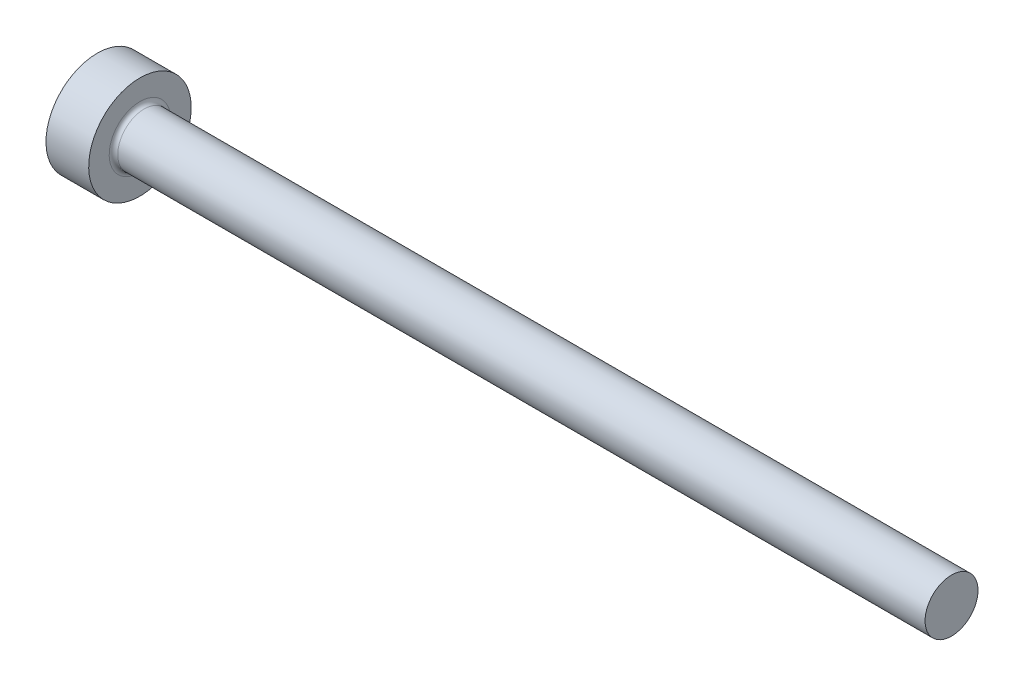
ISO-10303-21;
HEADER;
FILE_DESCRIPTION(('STEP AP214'),'2;1');
FILE_NAME('part.step','',(''),(''),'','','');
FILE_SCHEMA(('AUTOMOTIVE_DESIGN { 1 0 10303 214 1 1 1 1 }'));
ENDSEC;
DATA;
#1=APPLICATION_CONTEXT('core data for automotive mechanical design processes');
#2=APPLICATION_PROTOCOL_DEFINITION('international standard','automotive_design',2000,#1);
#3=PRODUCT_CONTEXT('',#1,'mechanical');
#4=PRODUCT('Part','Part','',(#3));
#5=PRODUCT_RELATED_PRODUCT_CATEGORY('part','',(#4));
#6=PRODUCT_DEFINITION_FORMATION('','',#4);
#7=PRODUCT_DEFINITION_CONTEXT('part definition',#1,'design');
#8=PRODUCT_DEFINITION('design','',#6,#7);
#9=PRODUCT_DEFINITION_SHAPE('','',#8);
#10=(LENGTH_UNIT() NAMED_UNIT(*) SI_UNIT(.MILLI.,.METRE.));
#11=(NAMED_UNIT(*) PLANE_ANGLE_UNIT() SI_UNIT($,.RADIAN.));
#12=(NAMED_UNIT(*) SI_UNIT($,.STERADIAN.) SOLID_ANGLE_UNIT());
#13=UNCERTAINTY_MEASURE_WITH_UNIT(LENGTH_MEASURE(1.E-05),#10,'distance_accuracy_value','');
#14=(GEOMETRIC_REPRESENTATION_CONTEXT(3) GLOBAL_UNCERTAINTY_ASSIGNED_CONTEXT((#13)) GLOBAL_UNIT_ASSIGNED_CONTEXT((#10,
#11,#12)) REPRESENTATION_CONTEXT('',''));
#15=CARTESIAN_POINT('',(0.,0.,0.));
#16=DIRECTION('',(0.,0.,1.));
#17=DIRECTION('',(1.,0.,0.));
#18=AXIS2_PLACEMENT_3D('',#15,#16,#17);
#19=CARTESIAN_POINT('',(0.,0.,0.));
#20=DIRECTION('',(-1.,0.,0.));
#21=DIRECTION('',(0.,-1.,0.));
#22=AXIS2_PLACEMENT_3D('',#19,#20,#21);
#23=PLANE('',#22);
#24=CARTESIAN_POINT('',(0.,0.,0.));
#25=DIRECTION('',(1.,0.,0.));
#26=DIRECTION('',(0.,1.,0.));
#27=AXIS2_PLACEMENT_3D('',#24,#25,#26);
#28=CIRCLE('',#27,6.);
#29=CARTESIAN_POINT('',(0.,6.,0.));
#30=VERTEX_POINT('',#29);
#31=EDGE_CURVE('E24',#30,#30,#28,.T.);
#32=ORIENTED_EDGE('',*,*,#31,.F.);
#33=EDGE_LOOP('',(#32));
#34=FACE_BOUND('',#33,.T.);
#35=ADVANCED_FACE('F13',(#34),#23,.T.);
#36=CARTESIAN_POINT('',(100.,0.,0.));
#37=DIRECTION('',(1.,0.,0.));
#38=DIRECTION('',(0.,1.,0.));
#39=AXIS2_PLACEMENT_3D('',#36,#37,#38);
#40=CYLINDRICAL_SURFACE('',#39,6.);
#41=ORIENTED_EDGE('',*,*,#31,.T.);
#42=EDGE_LOOP('',(#41));
#43=FACE_BOUND('',#42,.T.);
#44=CARTESIAN_POINT('',(5.,0.,0.));
#45=DIRECTION('',(1.,0.,0.));
#46=DIRECTION('',(0.,1.,0.));
#47=AXIS2_PLACEMENT_3D('',#44,#45,#46);
#48=CIRCLE('',#47,6.);
#49=CARTESIAN_POINT('',(5.00000000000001,6.,0.));
#50=VERTEX_POINT('',#49);
#51=EDGE_CURVE('E28',#50,#50,#48,.T.);
#52=ORIENTED_EDGE('',*,*,#51,.F.);
#53=EDGE_LOOP('',(#52));
#54=FACE_BOUND('',#53,.T.);
#55=ADVANCED_FACE('F49',(#43,#54),#40,.T.);
#56=CARTESIAN_POINT('',(5.,6.,0.));
#57=DIRECTION('',(1.,0.,0.));
#58=DIRECTION('',(0.,1.,0.));
#59=AXIS2_PLACEMENT_3D('',#56,#57,#58);
#60=PLANE('',#59);
#61=CARTESIAN_POINT('',(5.,0.,0.));
#62=DIRECTION('',(1.,0.,0.));
#63=DIRECTION('',(0.,1.,0.));
#64=AXIS2_PLACEMENT_3D('',#61,#62,#63);
#65=CIRCLE('',#64,3.59999999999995);
#66=CARTESIAN_POINT('',(5.,3.59999999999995,0.));
#67=VERTEX_POINT('',#66);
#68=EDGE_CURVE('E8',#67,#67,#65,.F.);
#69=ORIENTED_EDGE('',*,*,#68,.T.);
#70=EDGE_LOOP('',(#69));
#71=FACE_BOUND('',#70,.T.);
#72=ORIENTED_EDGE('',*,*,#51,.T.);
#73=EDGE_LOOP('',(#72));
#74=FACE_BOUND('',#73,.T.);
#75=ADVANCED_FACE('F41',(#71,#74),#60,.T.);
#76=CARTESIAN_POINT('',(100.,0.,0.));
#77=DIRECTION('',(1.,0.,0.));
#78=DIRECTION('',(0.,1.,0.));
#79=AXIS2_PLACEMENT_3D('',#76,#77,#78);
#80=CYLINDRICAL_SURFACE('',#79,3.09999999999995);
#81=CARTESIAN_POINT('',(5.5,0.,0.));
#82=DIRECTION('',(1.,0.,0.));
#83=DIRECTION('',(0.,1.,0.));
#84=AXIS2_PLACEMENT_3D('',#81,#82,#83);
#85=CIRCLE('',#84,3.09999999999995);
#86=CARTESIAN_POINT('',(5.5,3.09999999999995,0.));
#87=VERTEX_POINT('',#86);
#88=EDGE_CURVE('E20',#87,#87,#85,.T.);
#89=ORIENTED_EDGE('',*,*,#88,.T.);
#90=EDGE_LOOP('',(#89));
#91=FACE_BOUND('',#90,.T.);
#92=CARTESIAN_POINT('',(100.,0.,0.));
#93=DIRECTION('',(1.,0.,0.));
#94=DIRECTION('',(0.,1.,0.));
#95=AXIS2_PLACEMENT_3D('',#92,#93,#94);
#96=CIRCLE('',#95,3.1);
#97=CARTESIAN_POINT('',(100.,3.09999999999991,0.));
#98=VERTEX_POINT('',#97);
#99=EDGE_CURVE('E33',#98,#98,#96,.T.);
#100=ORIENTED_EDGE('',*,*,#99,.F.);
#101=EDGE_LOOP('',(#100));
#102=FACE_BOUND('',#101,.T.);
#103=ADVANCED_FACE('F39',(#91,#102),#80,.T.);
#104=CARTESIAN_POINT('',(100.,3.09999999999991,0.));
#105=DIRECTION('',(1.,0.,0.));
#106=DIRECTION('',(0.,1.,0.));
#107=AXIS2_PLACEMENT_3D('',#104,#105,#106);
#108=PLANE('',#107);
#109=ORIENTED_EDGE('',*,*,#99,.T.);
#110=EDGE_LOOP('',(#109));
#111=FACE_BOUND('',#110,.T.);
#112=ADVANCED_FACE('F37',(#111),#108,.T.);
#113=CARTESIAN_POINT('',(5.5,0.,0.));
#114=DIRECTION('',(1.,0.,0.));
#115=DIRECTION('',(0.,1.,0.));
#116=AXIS2_PLACEMENT_3D('',#113,#114,#115);
#117=TOROIDAL_SURFACE('',#116,3.59999999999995,0.5);
#118=ORIENTED_EDGE('',*,*,#68,.F.);
#119=EDGE_LOOP('',(#118));
#120=FACE_BOUND('',#119,.T.);
#121=ORIENTED_EDGE('',*,*,#88,.F.);
#122=EDGE_LOOP('',(#121));
#123=FACE_BOUND('',#122,.T.);
#124=ADVANCED_FACE('F15',(#120,#123),#117,.F.);
#125=CLOSED_SHELL('',(#35,#55,#75,#103,#112,#124));
#126=MANIFOLD_SOLID_BREP('B1',#125);
#127=ADVANCED_BREP_SHAPE_REPRESENTATION('',(#18,#126),#14);
#128=SHAPE_DEFINITION_REPRESENTATION(#9,#127);
ENDSEC;
END-ISO-10303-21;
